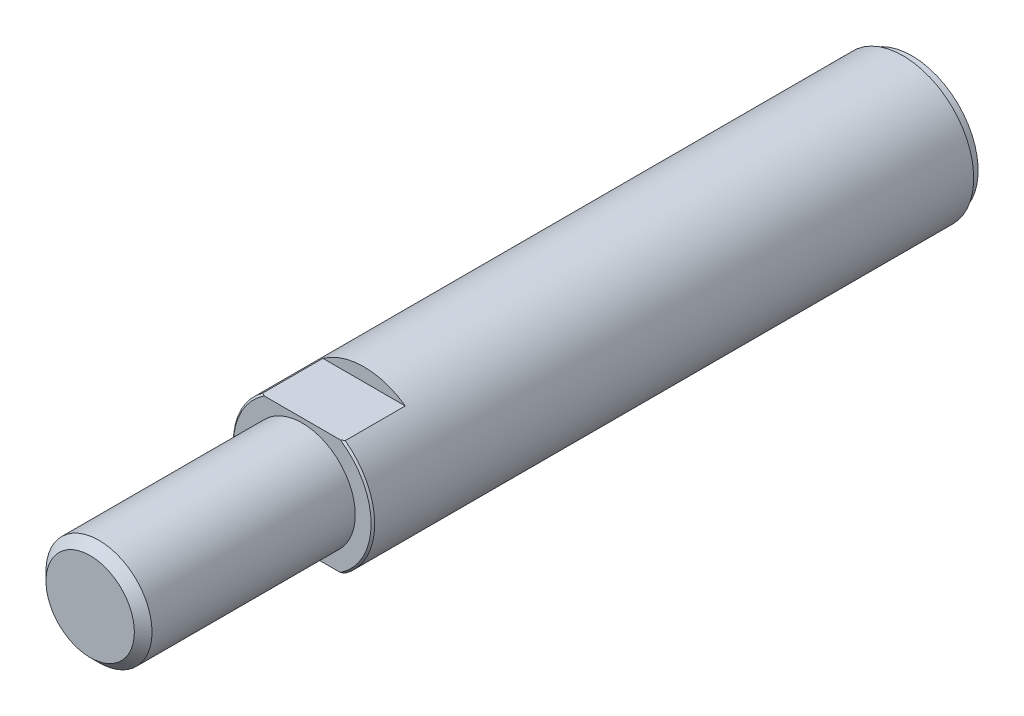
from build123d import *

# Parameters (mm, degrees)
ESBO_O1_R                      = 8
RESSALTO_EXTRUS_O1_DEPTH       = 93
ESBO_O2_OUTSIDE_W              = 37.142
ESBO_O2_OUTSIDE_H              = 37.142
ESBO_O2_OUTSIDE_R              = 6
CORTE_EXTRUS_O1_DEPTH          = 24
FURO_ROSCADO_DE_M8X1_251_D     = 6.8
FURO_ROSCADO_DE_M8X1_251_DEPTH = 22.25
FURO_ROSCADO_DE_M8X1_251_TIP   = 2.042926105
ESBO_O5_OUTSIDE_W              = 37.142
ESBO_O5_OUTSIDE_H              = 37.142
ESBO_O5_OUTSIDE_W_2            = 27.535637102
ESBO_O5_OUTSIDE_H_2            = 13
CORTE_EXTRUS_O2_DEPTH          = 7
CHANFRO1_SIZE                  = 0.2
CHANFRO2_SIZE                  = 1
ESBO_O6_OUTSIDE_W              = 37.142
ESBO_O6_OUTSIDE_H              = 37.142
ESBO_O6_OUTSIDE_R              = 7.5
CORTE_EXTRUS_O3_DEPTH          = 1


with BuildPart() as part:
    # Esbo_o1 → Ressalto-extrus_o1 (new body)
    with BuildSketch(Plane.XY):
        with Locations(Location((0, 0, 0), (0, 0, 180))):
            Circle(ESBO_O1_R)
    extrude(amount=RESSALTO_EXTRUS_O1_DEPTH)

    # Esbo_o2 outside → Corte-extrus_o1 (cut)
    with BuildSketch(Plane.XY.offset(93)):
        Rectangle(ESBO_O2_OUTSIDE_W, ESBO_O2_OUTSIDE_H)
        Circle(ESBO_O2_OUTSIDE_R, mode=Mode.SUBTRACT)
    extrude(amount=-CORTE_EXTRUS_O1_DEPTH, mode=Mode.SUBTRACT)

    # Furo roscado de M8x1.251
    with Locations(Plane(origin=(0, 0, 0), x_dir=(-1, 0, 0), z_dir=(0, 0, -1))):
        with Locations((0, 0)):
            Hole(FURO_ROSCADO_DE_M8X1_251_D / 2, depth=FURO_ROSCADO_DE_M8X1_251_DEPTH)
            with Locations((0, 0, -(FURO_ROSCADO_DE_M8X1_251_DEPTH + FURO_ROSCADO_DE_M8X1_251_TIP / 2))):  # 118° drill point
                Cone(0, FURO_ROSCADO_DE_M8X1_251_D / 2, FURO_ROSCADO_DE_M8X1_251_TIP, mode=Mode.SUBTRACT)

    # Esbo_o5 outside → Corte-extrus_o2 (cut)
    with BuildSketch(Plane.XY.offset(69)):
        Rectangle(ESBO_O5_OUTSIDE_W, ESBO_O5_OUTSIDE_H)
        Rectangle(ESBO_O5_OUTSIDE_W_2, ESBO_O5_OUTSIDE_H_2, mode=Mode.SUBTRACT)
    extrude(amount=-CORTE_EXTRUS_O2_DEPTH, mode=Mode.SUBTRACT)

    # Chanfro1
    chanfro1_edges = [part.edges().sort_by_distance(p)[0] for p in [
        (-7.117215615, -3.653114, 69),
        (8, 0, 69),
    ]]
    chamfer(chanfro1_edges, length=CHANFRO1_SIZE)

    # Chanfro2
    chanfro2_edges = [part.edges().sort_by_distance(p)[0] for p in [
        (-6, 0, 93),
    ]]
    chamfer(chanfro2_edges, length=CHANFRO2_SIZE)

    # Esbo_o6 outside → Corte-extrus_o3 (cut)
    with BuildSketch(Plane(origin=(0, 0, 0), x_dir=(-1, 0, 0), z_dir=(0, 0, -1))):
        Rectangle(ESBO_O6_OUTSIDE_W, ESBO_O6_OUTSIDE_H)
        Circle(ESBO_O6_OUTSIDE_R, mode=Mode.SUBTRACT)
    extrude(amount=-CORTE_EXTRUS_O3_DEPTH, mode=Mode.SUBTRACT)


solid = part.part
